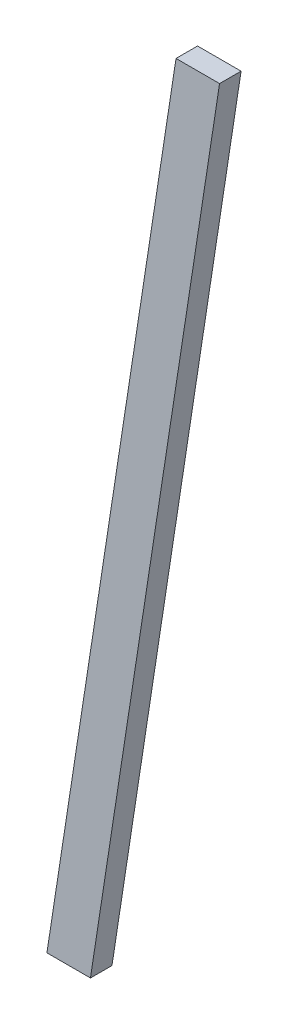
from build123d import *

# Parameters (mm, degrees)
BOSS_EXTRUDE1_DEPTH = 50.8


with BuildPart() as part:
    # Sketch1 → Boss-Extrude1 (new body)
    with BuildSketch(Plane.XY):
        Polygon((-1219.2, 0), (-914.4, 1981.2), (-811.604664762, 1981.2), (-1116.404664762, 0), align=None)
    extrude(amount=BOSS_EXTRUDE1_DEPTH)


solid = part.part
